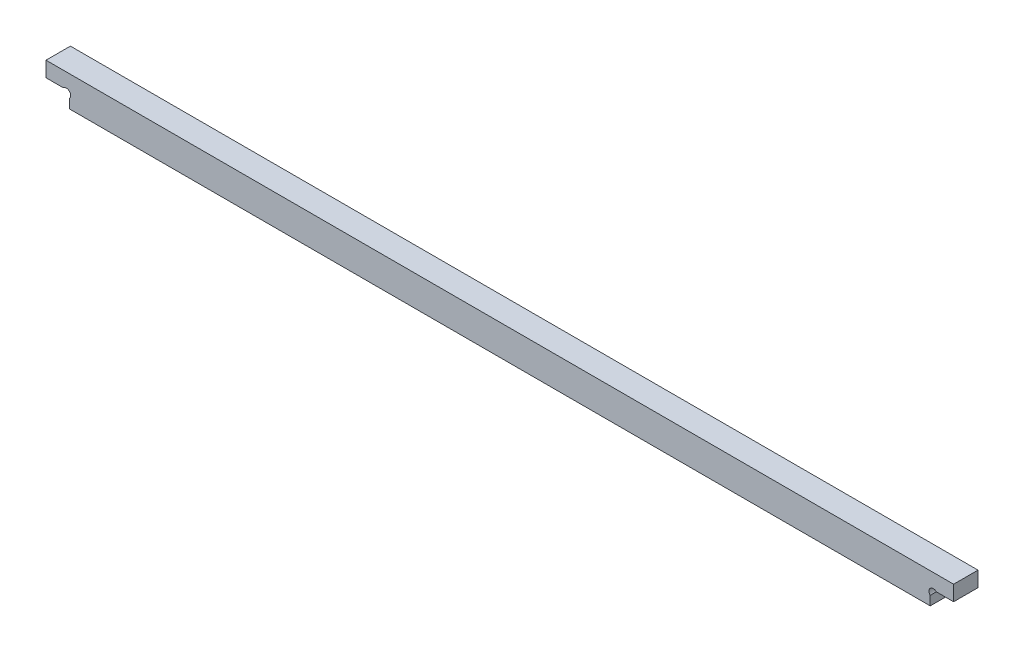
from build123d import *

# Parameters (mm, degrees)
SKETCH_1_W          = 893
SKETCH_1_H          = 30
EXTRUDE_1_DEPTH     = 24
CUT_EXTRUDE_1_DEPTH = 448.396077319


with BuildPart() as part:
    # Sketch 1 → Extrude 1 (new body)
    with BuildSketch(Plane.XY):
        Rectangle(SKETCH_1_W, SKETCH_1_H)
    extrude(amount=EXTRUDE_1_DEPTH)

    # Sketch 2 → Cut-Extrude 1 (cut, through all)
    with BuildSketch(Plane.XY.offset(24)):
        with BuildLine():
            Line((-446.5, -15), (-423.5, -15))
            Line((-423.5, -15), (-423.5, -6.010398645))
            ThreePointArc((-423.5, -6.010398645), (-423.49479618, 0.00520382), (-429.510398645, 0))
            Line((-429.510398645, 0), (-446.5, 0))
            Line((-446.5, 0), (-446.5, -15))
        make_face()
        with BuildLine():
            Line((423.5, -15), (423.5, -6.010398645))
            ThreePointArc((423.5, -6.010398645), (423.49479618, 0.00520382), (429.510398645, 0))
            Line((429.510398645, 0), (446.5, 0))
            Line((446.5, 0), (446.5, -15))
            Line((446.5, -15), (423.5, -15))
        make_face()
    extrude(amount=-CUT_EXTRUDE_1_DEPTH, mode=Mode.SUBTRACT)


solid = part.part
